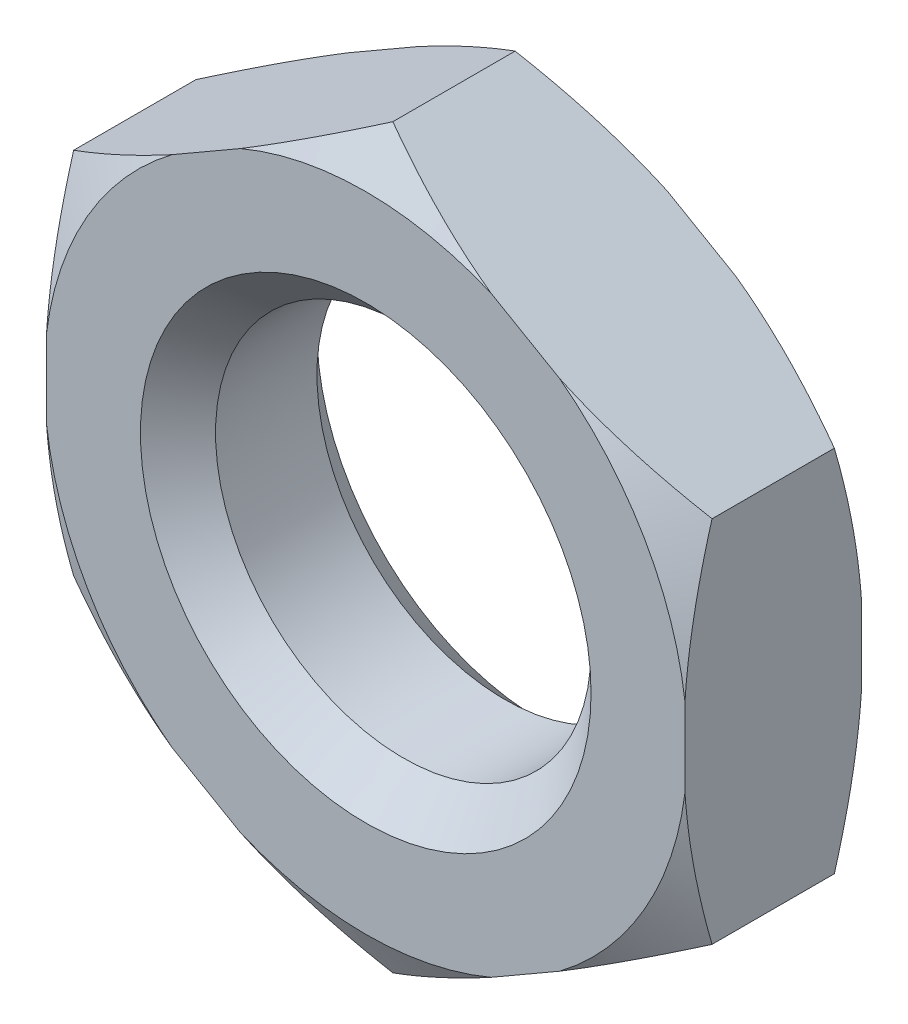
from build123d import *

# Parameters (mm, degrees)
BOSS_EXTRUDE1_DEPTH = 2.35
SKETCH6_R           = 5
CUT_EXTRUDE1_DEPTH  = 4.7
CHAMFER1_SIZE       = 1


with BuildPart() as part:
    # Sketch3 → Boss-Extrude1 (new, symmetric)
    with BuildSketch(Plane.XY):
        Polygon((0, 9.814954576), (-8.5, 4.907477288), (-8.5, -4.907477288), (0, -9.814954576), (8.5, -4.907477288), (8.5, 4.907477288), align=None)
    extrude(amount=BOSS_EXTRUDE1_DEPTH, both=True)

    # Sketch5 → Cut-Revolve1 (revolve, cut)
    with BuildSketch(Plane(origin=(0, 0, 0), x_dir=(0, 0, -1), z_dir=(1, 0, 0))):
        Polygon((-2.35, 9.814954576), (-2.35, 8.564954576), (-1.628312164, 9.814954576), align=None)
    cut_revolve1 = revolve(axis=Axis((0, 0, 5.457798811), (0, 0, -1)), mode=Mode.SUBTRACT)

    # Mirror1: Cut-Revolve1 across plane
    add(cut_revolve1.mirror(Plane.XY), mode=Mode.SUBTRACT)

    # Sketch6 → Cut-Extrude1 (cut)
    with BuildSketch(Plane.XY.offset(2.35)):
        Circle(SKETCH6_R)
    extrude(amount=-CUT_EXTRUDE1_DEPTH, mode=Mode.SUBTRACT)

    # Chamfer1
    chamfer1_edges = [part.edges().sort_by_distance(p)[0] for p in [
        (-5, 0, -2.35),
        (-5, 0, 2.35),
    ]]
    chamfer(chamfer1_edges, length=CHAMFER1_SIZE)


solid = part.part
